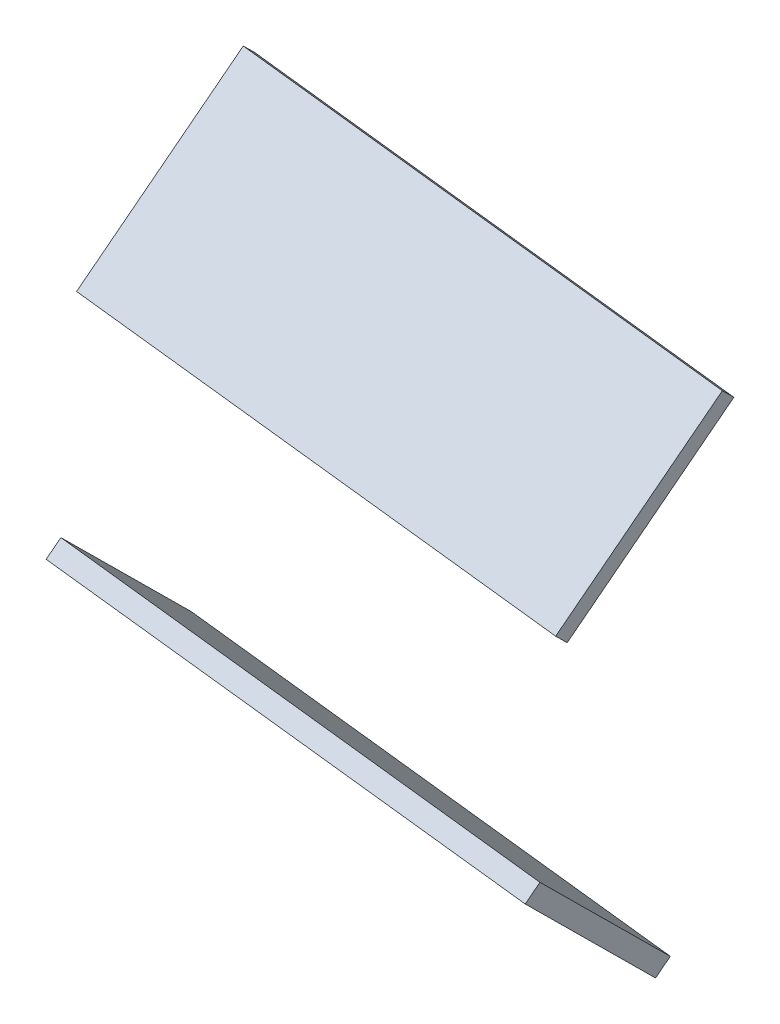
ISO-10303-21;
HEADER;
FILE_DESCRIPTION(('STEP AP214'),'2;1');
FILE_NAME('part.step','',(''),(''),'','','');
FILE_SCHEMA(('AUTOMOTIVE_DESIGN { 1 0 10303 214 1 1 1 1 }'));
ENDSEC;
DATA;
#1=APPLICATION_CONTEXT('core data for automotive mechanical design processes');
#2=APPLICATION_PROTOCOL_DEFINITION('international standard','automotive_design',2000,#1);
#3=PRODUCT_CONTEXT('',#1,'mechanical');
#4=PRODUCT('Part','Part','',(#3));
#5=PRODUCT_RELATED_PRODUCT_CATEGORY('part','',(#4));
#6=PRODUCT_DEFINITION_FORMATION('','',#4);
#7=PRODUCT_DEFINITION_CONTEXT('part definition',#1,'design');
#8=PRODUCT_DEFINITION('design','',#6,#7);
#9=PRODUCT_DEFINITION_SHAPE('','',#8);
#10=(LENGTH_UNIT() NAMED_UNIT(*) SI_UNIT(.MILLI.,.METRE.));
#11=(NAMED_UNIT(*) PLANE_ANGLE_UNIT() SI_UNIT($,.RADIAN.));
#12=(NAMED_UNIT(*) SI_UNIT($,.STERADIAN.) SOLID_ANGLE_UNIT());
#13=UNCERTAINTY_MEASURE_WITH_UNIT(LENGTH_MEASURE(1.E-05),#10,'distance_accuracy_value','');
#14=(GEOMETRIC_REPRESENTATION_CONTEXT(3) GLOBAL_UNCERTAINTY_ASSIGNED_CONTEXT((#13)) GLOBAL_UNIT_ASSIGNED_CONTEXT((#10,
#11,#12)) REPRESENTATION_CONTEXT('',''));
#15=CARTESIAN_POINT('',(0.,0.,0.));
#16=DIRECTION('',(0.,0.,1.));
#17=DIRECTION('',(1.,0.,0.));
#18=AXIS2_PLACEMENT_3D('',#15,#16,#17);
#19=CARTESIAN_POINT('',(62.2015500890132,11.5314912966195,11.5774679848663));
#20=DIRECTION('',(-0.0864538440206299,-0.701801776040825,-0.707106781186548));
#21=DIRECTION('',(0.,0.709764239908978,-0.704439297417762));
#22=AXIS2_PLACEMENT_3D('',#19,#20,#21);
#23=PLANE('',#22);
#24=DIRECTION('',(-0.08645384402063,-0.701801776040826,0.707106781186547));
#25=VECTOR('',#24,1.);
#26=CARTESIAN_POINT('',(-35.5306943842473,49.1629726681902,-13.8225320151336));
#27=LINE('',#26,#25);
#28=CARTESIAN_POINT('',(-35.5306943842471,49.1629726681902,-13.8225320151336));
#29=VERTEX_POINT('',#28);
#30=CARTESIAN_POINT('',(-38.636205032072,23.953533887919,11.5774679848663));
#31=VERTEX_POINT('',#30);
#32=EDGE_CURVE('P0_E67',#29,#31,#27,.T.);
#33=ORIENTED_EDGE('',*,*,#32,.F.);
#34=DIRECTION('',(-0.992497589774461,0.122264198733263,0.));
#35=VECTOR('',#34,1.);
#36=CARTESIAN_POINT('',(46.3999816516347,39.0700630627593,-13.8225320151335));
#37=LINE('',#36,#35);
#38=CARTESIAN_POINT('',(46.3999816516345,39.0700630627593,-13.8225320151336));
#39=VERTEX_POINT('',#38);
#40=EDGE_CURVE('P0_E54',#39,#29,#37,.T.);
#41=ORIENTED_EDGE('',*,*,#40,.F.);
#42=DIRECTION('',(-0.08645384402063,-0.701801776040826,0.707106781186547));
#43=VECTOR('',#42,1.);
#44=CARTESIAN_POINT('',(46.3999816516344,39.0700630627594,-13.8225320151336));
#45=LINE('',#44,#43);
#46=CARTESIAN_POINT('',(43.2944710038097,13.8606242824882,11.5774679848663));
#47=VERTEX_POINT('',#46);
#48=EDGE_CURVE('P0_E19',#39,#47,#45,.T.);
#49=ORIENTED_EDGE('',*,*,#48,.T.);
#50=DIRECTION('',(0.99249758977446,-0.122264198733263,0.));
#51=VECTOR('',#50,1.);
#52=CARTESIAN_POINT('',(-38.6362050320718,23.953533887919,11.5774679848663));
#53=LINE('',#52,#51);
#54=EDGE_CURVE('P0_E80',#31,#47,#53,.T.);
#55=ORIENTED_EDGE('',*,*,#54,.F.);
#56=EDGE_LOOP('',(#33,#41,#49,#55));
#57=FACE_BOUND('',#56,.T.);
#58=ADVANCED_FACE('P0_F16',(#57),#23,.T.);
#59=CARTESIAN_POINT('',(46.6744726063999,41.2982837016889,-11.5774679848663));
#60=DIRECTION('',(-0.99249758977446,0.122264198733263,0.));
#61=DIRECTION('',(-0.122264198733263,-0.99249758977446,0.));
#62=AXIS2_PLACEMENT_3D('',#59,#60,#61);
#63=PLANE('',#62);
#64=DIRECTION('',(0.0864538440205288,0.701801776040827,0.707106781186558));
#65=VECTOR('',#64,1.);
#66=CARTESIAN_POINT('',(43.2944710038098,13.8606242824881,11.5774679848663));
#67=LINE('',#66,#65);
#68=CARTESIAN_POINT('',(43.568961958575,16.0888449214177,13.8225320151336));
#69=VERTEX_POINT('',#68);
#70=EDGE_CURVE('P0_E63',#47,#69,#67,.T.);
#71=ORIENTED_EDGE('',*,*,#70,.F.);
#72=ORIENTED_EDGE('',*,*,#48,.F.);
#73=DIRECTION('',(-0.0864538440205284,-0.701801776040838,-0.707106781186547));
#74=VECTOR('',#73,1.);
#75=CARTESIAN_POINT('',(46.6744726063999,41.2982837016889,-11.5774679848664));
#76=LINE('',#75,#74);
#77=CARTESIAN_POINT('',(46.6744726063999,41.2982837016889,-11.5774679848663));
#78=VERTEX_POINT('',#77);
#79=EDGE_CURVE('P0_E60',#78,#39,#76,.T.);
#80=ORIENTED_EDGE('',*,*,#79,.F.);
#81=DIRECTION('',(0.08645384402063,0.701801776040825,-0.707106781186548));
#82=VECTOR('',#81,1.);
#83=CARTESIAN_POINT('',(43.568961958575,16.0888449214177,13.8225320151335));
#84=LINE('',#83,#82);
#85=EDGE_CURVE('P0_E82',#69,#78,#84,.T.);
#86=ORIENTED_EDGE('',*,*,#85,.F.);
#87=EDGE_LOOP('',(#71,#72,#80,#86));
#88=FACE_BOUND('',#87,.T.);
#89=ADVANCED_FACE('P0_F59',(#88),#63,.F.);
#90=CARTESIAN_POINT('',(65.3070607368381,36.7409300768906,-13.8225320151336));
#91=DIRECTION('',(0.08645384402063,0.701801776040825,-0.707106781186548));
#92=DIRECTION('',(0.,0.709764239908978,0.704439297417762));
#93=AXIS2_PLACEMENT_3D('',#90,#91,#92);
#94=PLANE('',#93);
#95=DIRECTION('',(-0.0864538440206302,-0.701801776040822,-0.70710678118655));
#96=VECTOR('',#95,1.);
#97=CARTESIAN_POINT('',(-35.2562034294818,51.3911933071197,-11.5774679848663));
#98=LINE('',#97,#96);
#99=CARTESIAN_POINT('',(-35.2562034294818,51.3911933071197,-11.5774679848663));
#100=VERTEX_POINT('',#99);
#101=EDGE_CURVE('P0_E69',#100,#29,#98,.T.);
#102=ORIENTED_EDGE('',*,*,#101,.F.);
#103=DIRECTION('',(-0.99249758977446,0.122264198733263,0.));
#104=VECTOR('',#103,1.);
#105=CARTESIAN_POINT('',(46.6744726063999,41.2982837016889,-11.5774679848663));
#106=LINE('',#105,#104);
#107=EDGE_CURVE('P0_E73',#78,#100,#106,.T.);
#108=ORIENTED_EDGE('',*,*,#107,.F.);
#109=ORIENTED_EDGE('',*,*,#79,.T.);
#110=ORIENTED_EDGE('',*,*,#40,.T.);
#111=EDGE_LOOP('',(#102,#108,#109,#110));
#112=FACE_BOUND('',#111,.T.);
#113=ADVANCED_FACE('P0_F71',(#112),#94,.T.);
#114=CARTESIAN_POINT('',(-35.2562034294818,51.3911933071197,-11.5774679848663));
#115=DIRECTION('',(-0.99249758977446,0.122264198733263,0.));
#116=DIRECTION('',(-0.122264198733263,-0.99249758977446,0.));
#117=AXIS2_PLACEMENT_3D('',#114,#115,#116);
#118=PLANE('',#117);
#119=ORIENTED_EDGE('',*,*,#32,.T.);
#120=DIRECTION('',(-0.086453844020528,-0.701801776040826,-0.707106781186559));
#121=VECTOR('',#120,1.);
#122=CARTESIAN_POINT('',(-38.3617140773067,26.1817545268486,13.8225320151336));
#123=LINE('',#122,#121);
#124=CARTESIAN_POINT('',(-38.3617140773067,26.1817545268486,13.8225320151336));
#125=VERTEX_POINT('',#124);
#126=EDGE_CURVE('P0_E34',#125,#31,#123,.T.);
#127=ORIENTED_EDGE('',*,*,#126,.F.);
#128=DIRECTION('',(-0.08645384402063,-0.701801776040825,0.707106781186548));
#129=VECTOR('',#128,1.);
#130=CARTESIAN_POINT('',(-35.2562034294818,51.3911933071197,-11.5774679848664));
#131=LINE('',#130,#129);
#132=EDGE_CURVE('P0_E25',#100,#125,#131,.T.);
#133=ORIENTED_EDGE('',*,*,#132,.F.);
#134=ORIENTED_EDGE('',*,*,#101,.T.);
#135=EDGE_LOOP('',(#119,#127,#133,#134));
#136=FACE_BOUND('',#135,.T.);
#137=ADVANCED_FACE('P0_F88',(#136),#118,.T.);
#138=CARTESIAN_POINT('',(62.4760410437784,13.7597119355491,13.8225320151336));
#139=DIRECTION('',(-0.0864538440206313,-0.701801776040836,0.707106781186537));
#140=DIRECTION('',(0.,-0.709764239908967,-0.704439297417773));
#141=AXIS2_PLACEMENT_3D('',#138,#139,#140);
#142=PLANE('',#141);
#143=ORIENTED_EDGE('',*,*,#126,.T.);
#144=ORIENTED_EDGE('',*,*,#54,.T.);
#145=ORIENTED_EDGE('',*,*,#70,.T.);
#146=DIRECTION('',(0.99249758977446,-0.122264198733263,0.));
#147=VECTOR('',#146,1.);
#148=CARTESIAN_POINT('',(-38.3617140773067,26.1817545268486,13.8225320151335));
#149=LINE('',#148,#147);
#150=EDGE_CURVE('P0_E11',#125,#69,#149,.T.);
#151=ORIENTED_EDGE('',*,*,#150,.F.);
#152=EDGE_LOOP('',(#143,#144,#145,#151));
#153=FACE_BOUND('',#152,.T.);
#154=ADVANCED_FACE('P0_F90',(#153),#142,.T.);
#155=CARTESIAN_POINT('',(65.5815516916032,38.9691507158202,-11.5774679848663));
#156=DIRECTION('',(0.08645384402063,0.701801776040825,0.707106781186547));
#157=DIRECTION('',(0.,-0.709764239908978,0.704439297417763));
#158=AXIS2_PLACEMENT_3D('',#155,#156,#157);
#159=PLANE('',#158);
#160=ORIENTED_EDGE('',*,*,#132,.T.);
#161=ORIENTED_EDGE('',*,*,#150,.T.);
#162=ORIENTED_EDGE('',*,*,#85,.T.);
#163=ORIENTED_EDGE('',*,*,#107,.T.);
#164=EDGE_LOOP('',(#160,#161,#162,#163));
#165=FACE_BOUND('',#164,.T.);
#166=ADVANCED_FACE('P0_F87',(#165),#159,.T.);
#167=CLOSED_SHELL('',(#58,#89,#113,#137,#154,#166));
#168=MANIFOLD_SOLID_BREP('P0_B1',#167);
#169=CARTESIAN_POINT('',(57.26879316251,-28.5108875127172,13.8225320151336));
#170=DIRECTION('',(-0.08645384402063,-0.701801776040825,0.707106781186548));
#171=DIRECTION('',(0.,-0.709764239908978,-0.704439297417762));
#172=AXIS2_PLACEMENT_3D('',#169,#170,#171);
#173=PLANE('',#172);
#174=DIRECTION('',(-0.08645384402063,-0.701801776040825,-0.707106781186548));
#175=VECTOR('',#174,1.);
#176=CARTESIAN_POINT('',(-43.5689619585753,-16.0888449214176,13.8225320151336));
#177=LINE('',#176,#175);
#178=CARTESIAN_POINT('',(-43.5689619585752,-16.0888449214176,13.8225320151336));
#179=VERTEX_POINT('',#178);
#180=CARTESIAN_POINT('',(-46.6744726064,-41.2982837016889,-11.5774679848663));
#181=VERTEX_POINT('',#180);
#182=EDGE_CURVE('P1_E54',#179,#181,#177,.T.);
#183=ORIENTED_EDGE('',*,*,#182,.T.);
#184=DIRECTION('',(-0.992497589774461,0.122264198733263,0.));
#185=VECTOR('',#184,1.);
#186=CARTESIAN_POINT('',(35.2562034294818,-51.3911933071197,-11.5774679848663));
#187=LINE('',#186,#185);
#188=CARTESIAN_POINT('',(35.256203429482,-51.3911933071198,-11.5774679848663));
#189=VERTEX_POINT('',#188);
#190=EDGE_CURVE('P1_E66',#189,#181,#187,.T.);
#191=ORIENTED_EDGE('',*,*,#190,.F.);
#192=DIRECTION('',(-0.08645384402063,-0.701801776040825,-0.707106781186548));
#193=VECTOR('',#192,1.);
#194=CARTESIAN_POINT('',(38.3617140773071,-26.1817545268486,13.8225320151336));
#195=LINE('',#194,#193);
#196=CARTESIAN_POINT('',(38.3617140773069,-26.1817545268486,13.8225320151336));
#197=VERTEX_POINT('',#196);
#198=EDGE_CURVE('P1_E19',#197,#189,#195,.T.);
#199=ORIENTED_EDGE('',*,*,#198,.F.);
#200=DIRECTION('',(0.99249758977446,-0.122264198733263,0.));
#201=VECTOR('',#200,1.);
#202=CARTESIAN_POINT('',(-43.568961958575,-16.0888449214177,13.8225320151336));
#203=LINE('',#202,#201);
#204=EDGE_CURVE('P1_E80',#179,#197,#203,.T.);
#205=ORIENTED_EDGE('',*,*,#204,.F.);
#206=EDGE_LOOP('',(#183,#191,#199,#205));
#207=FACE_BOUND('',#206,.T.);
#208=ADVANCED_FACE('P1_F16',(#207),#173,.T.);
#209=CARTESIAN_POINT('',(35.5306943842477,-49.1629726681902,-13.8225320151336));
#210=DIRECTION('',(0.99249758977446,-0.122264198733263,0.));
#211=DIRECTION('',(0.122264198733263,0.99249758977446,0.));
#212=AXIS2_PLACEMENT_3D('',#209,#210,#211);
#213=PLANE('',#212);
#214=ORIENTED_EDGE('',*,*,#198,.T.);
#215=DIRECTION('',(-0.0864538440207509,-0.701801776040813,0.707106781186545));
#216=VECTOR('',#215,1.);
#217=CARTESIAN_POINT('',(35.5306943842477,-49.1629726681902,-13.8225320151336));
#218=LINE('',#217,#216);
#219=CARTESIAN_POINT('',(35.5306943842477,-49.1629726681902,-13.8225320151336));
#220=VERTEX_POINT('',#219);
#221=EDGE_CURVE('P1_E61',#220,#189,#218,.T.);
#222=ORIENTED_EDGE('',*,*,#221,.F.);
#223=DIRECTION('',(-0.08645384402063,-0.701801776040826,-0.707106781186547));
#224=VECTOR('',#223,1.);
#225=CARTESIAN_POINT('',(38.6362050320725,-23.953533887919,11.5774679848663));
#226=LINE('',#225,#224);
#227=CARTESIAN_POINT('',(38.6362050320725,-23.953533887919,11.5774679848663));
#228=VERTEX_POINT('',#227);
#229=EDGE_CURVE('P1_E82',#228,#220,#226,.T.);
#230=ORIENTED_EDGE('',*,*,#229,.F.);
#231=DIRECTION('',(0.0864538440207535,0.701801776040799,-0.707106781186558));
#232=VECTOR('',#231,1.);
#233=CARTESIAN_POINT('',(38.3617140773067,-26.1817545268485,13.8225320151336));
#234=LINE('',#233,#232);
#235=EDGE_CURVE('P1_E64',#197,#228,#234,.T.);
#236=ORIENTED_EDGE('',*,*,#235,.F.);
#237=EDGE_LOOP('',(#214,#222,#230,#236));
#238=FACE_BOUND('',#237,.T.);
#239=ADVANCED_FACE('P1_F59',(#238),#213,.T.);
#240=CARTESIAN_POINT('',(54.1632825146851,-53.7203262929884,-11.5774679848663));
#241=DIRECTION('',(-0.0864538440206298,-0.701801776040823,-0.707106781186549));
#242=DIRECTION('',(0.,0.70976423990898,-0.704439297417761));
#243=AXIS2_PLACEMENT_3D('',#240,#241,#242);
#244=PLANE('',#243);
#245=DIRECTION('',(0.0864538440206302,0.701801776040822,-0.70710678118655));
#246=VECTOR('',#245,1.);
#247=CARTESIAN_POINT('',(-46.6744726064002,-41.2982837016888,-11.5774679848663));
#248=LINE('',#247,#246);
#249=CARTESIAN_POINT('',(-46.3999816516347,-39.0700630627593,-13.8225320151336));
#250=VERTEX_POINT('',#249);
#251=EDGE_CURVE('P1_E76',#181,#250,#248,.T.);
#252=ORIENTED_EDGE('',*,*,#251,.T.);
#253=DIRECTION('',(-0.99249758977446,0.122264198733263,0.));
#254=VECTOR('',#253,1.);
#255=CARTESIAN_POINT('',(35.5306943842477,-49.1629726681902,-13.8225320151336));
#256=LINE('',#255,#254);
#257=EDGE_CURVE('P1_E72',#220,#250,#256,.T.);
#258=ORIENTED_EDGE('',*,*,#257,.F.);
#259=ORIENTED_EDGE('',*,*,#221,.T.);
#260=ORIENTED_EDGE('',*,*,#190,.T.);
#261=EDGE_LOOP('',(#252,#258,#259,#260));
#262=FACE_BOUND('',#261,.T.);
#263=ADVANCED_FACE('P1_F70',(#262),#244,.T.);
#264=CARTESIAN_POINT('',(-46.3999816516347,-39.0700630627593,-13.8225320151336));
#265=DIRECTION('',(0.99249758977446,-0.122264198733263,0.));
#266=DIRECTION('',(0.122264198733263,0.99249758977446,0.));
#267=AXIS2_PLACEMENT_3D('',#264,#265,#266);
#268=PLANE('',#267);
#269=ORIENTED_EDGE('',*,*,#251,.F.);
#270=ORIENTED_EDGE('',*,*,#182,.F.);
#271=DIRECTION('',(-0.0864538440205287,-0.701801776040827,0.707106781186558));
#272=VECTOR('',#271,1.);
#273=CARTESIAN_POINT('',(-43.2944710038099,-13.8606242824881,11.5774679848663));
#274=LINE('',#273,#272);
#275=CARTESIAN_POINT('',(-43.2944710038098,-13.8606242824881,11.5774679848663));
#276=VERTEX_POINT('',#275);
#277=EDGE_CURVE('P1_E34',#276,#179,#274,.T.);
#278=ORIENTED_EDGE('',*,*,#277,.F.);
#279=DIRECTION('',(0.0864538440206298,0.701801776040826,0.707106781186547));
#280=VECTOR('',#279,1.);
#281=CARTESIAN_POINT('',(-46.3999816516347,-39.0700630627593,-13.8225320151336));
#282=LINE('',#281,#280);
#283=EDGE_CURVE('P1_E25',#250,#276,#282,.T.);
#284=ORIENTED_EDGE('',*,*,#283,.F.);
#285=EDGE_LOOP('',(#269,#270,#278,#284));
#286=FACE_BOUND('',#285,.T.);
#287=ADVANCED_FACE('P1_F88',(#286),#268,.F.);
#288=CARTESIAN_POINT('',(57.5432841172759,-26.2826668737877,11.5774679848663));
#289=DIRECTION('',(0.0864538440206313,0.701801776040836,0.707106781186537));
#290=DIRECTION('',(0.,-0.709764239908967,0.704439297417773));
#291=AXIS2_PLACEMENT_3D('',#288,#289,#290);
#292=PLANE('',#291);
#293=ORIENTED_EDGE('',*,*,#277,.T.);
#294=ORIENTED_EDGE('',*,*,#204,.T.);
#295=ORIENTED_EDGE('',*,*,#235,.T.);
#296=DIRECTION('',(0.992497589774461,-0.122264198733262,0.));
#297=VECTOR('',#296,1.);
#298=CARTESIAN_POINT('',(-43.2944710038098,-13.8606242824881,11.5774679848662));
#299=LINE('',#298,#297);
#300=EDGE_CURVE('P1_E11',#276,#228,#299,.T.);
#301=ORIENTED_EDGE('',*,*,#300,.F.);
#302=EDGE_LOOP('',(#293,#294,#295,#301));
#303=FACE_BOUND('',#302,.T.);
#304=ADVANCED_FACE('P1_F90',(#303),#292,.T.);
#305=CARTESIAN_POINT('',(54.437773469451,-51.4921056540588,-13.8225320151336));
#306=DIRECTION('',(0.0864538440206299,0.701801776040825,-0.707106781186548));
#307=DIRECTION('',(0.,0.709764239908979,0.704439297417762));
#308=AXIS2_PLACEMENT_3D('',#305,#306,#307);
#309=PLANE('',#308);
#310=ORIENTED_EDGE('',*,*,#283,.T.);
#311=ORIENTED_EDGE('',*,*,#300,.T.);
#312=ORIENTED_EDGE('',*,*,#229,.T.);
#313=ORIENTED_EDGE('',*,*,#257,.T.);
#314=EDGE_LOOP('',(#310,#311,#312,#313));
#315=FACE_BOUND('',#314,.T.);
#316=ADVANCED_FACE('P1_F87',(#315),#309,.T.);
#317=CLOSED_SHELL('',(#208,#239,#263,#287,#304,#316));
#318=MANIFOLD_SOLID_BREP('P1_B1',#317);
#319=ADVANCED_BREP_SHAPE_REPRESENTATION('',(#18,#168,#318),#14);
#320=SHAPE_DEFINITION_REPRESENTATION(#9,#319);
ENDSEC;
END-ISO-10303-21;
